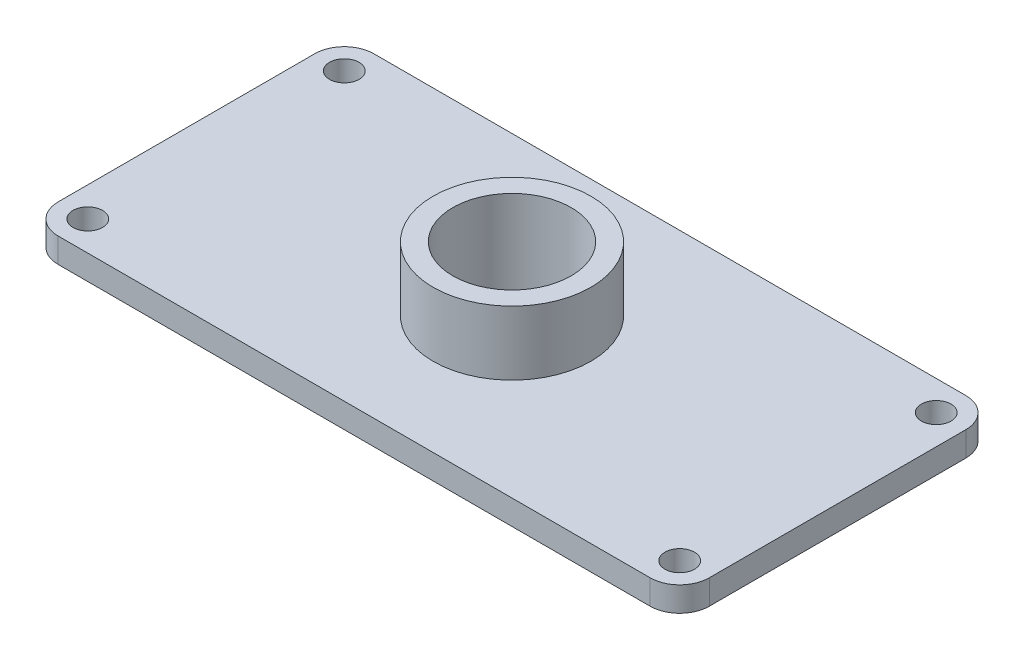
from build123d import *

# Parameters (mm, degrees)
SKETCH1_R           = 12
SKETCH1_R_2         = 3
BOSS_EXTRUDE1_DEPTH = 5
SKETCH2_R           = 16
SKETCH2_R_2         = 12
BOSS_EXTRUDE2_DEPTH = 13


with BuildPart() as part:
    # Sketch1 → Boss-Extrude1 (new body)
    with BuildSketch(Plane(origin=(0, 0, 0), x_dir=(1, 0, 0), z_dir=(0, 1, 0))):
        with BuildLine():
            Line((-60, -32), (60, -32))
            ThreePointArc((60, -32), (64.242640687, -30.242640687), (66, -26))
            Line((66, -26), (66, 26))
            ThreePointArc((66, 26), (64.242640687, 30.242640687), (60, 32))
            Line((60, 32), (-60, 32))
            ThreePointArc((-60, 32), (-64.242640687, 30.242640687), (-66, 26))
            Line((-66, 26), (-66, -26))
            ThreePointArc((-66, -26), (-64.242640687, -30.242640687), (-60, -32))
        make_face()
        with Locations(Location((0, 0, 0), (0, 0, 270))):
            Circle(SKETCH1_R, mode=Mode.SUBTRACT)
        with Locations(Location((-60, 26, 0), (0, 0, 270))):
            Circle(SKETCH1_R_2, mode=Mode.SUBTRACT)
        with Locations(Location((60, 26, 0), (0, 0, 270))):
            Circle(SKETCH1_R_2, mode=Mode.SUBTRACT)
        with Locations(Location((60, -26, 0), (0, 0, 270))):
            Circle(SKETCH1_R_2, mode=Mode.SUBTRACT)
        with Locations(Location((-60, -26, 0), (0, 0, 270))):
            Circle(SKETCH1_R_2, mode=Mode.SUBTRACT)
    extrude(amount=BOSS_EXTRUDE1_DEPTH)

    # Sketch2 → Boss-Extrude2 (add)
    with BuildSketch(Plane(origin=(0, 5, 0), x_dir=(1, 0, 0), z_dir=(0, 1, 0))):
        with Locations(Location((0, 0, 0), (0, 0, 90))):
            Circle(SKETCH2_R)
        with Locations(Location((0, 0, 0), (0, 0, 270))):
            Circle(SKETCH2_R_2, mode=Mode.SUBTRACT)
    extrude(amount=BOSS_EXTRUDE2_DEPTH)


solid = part.part
